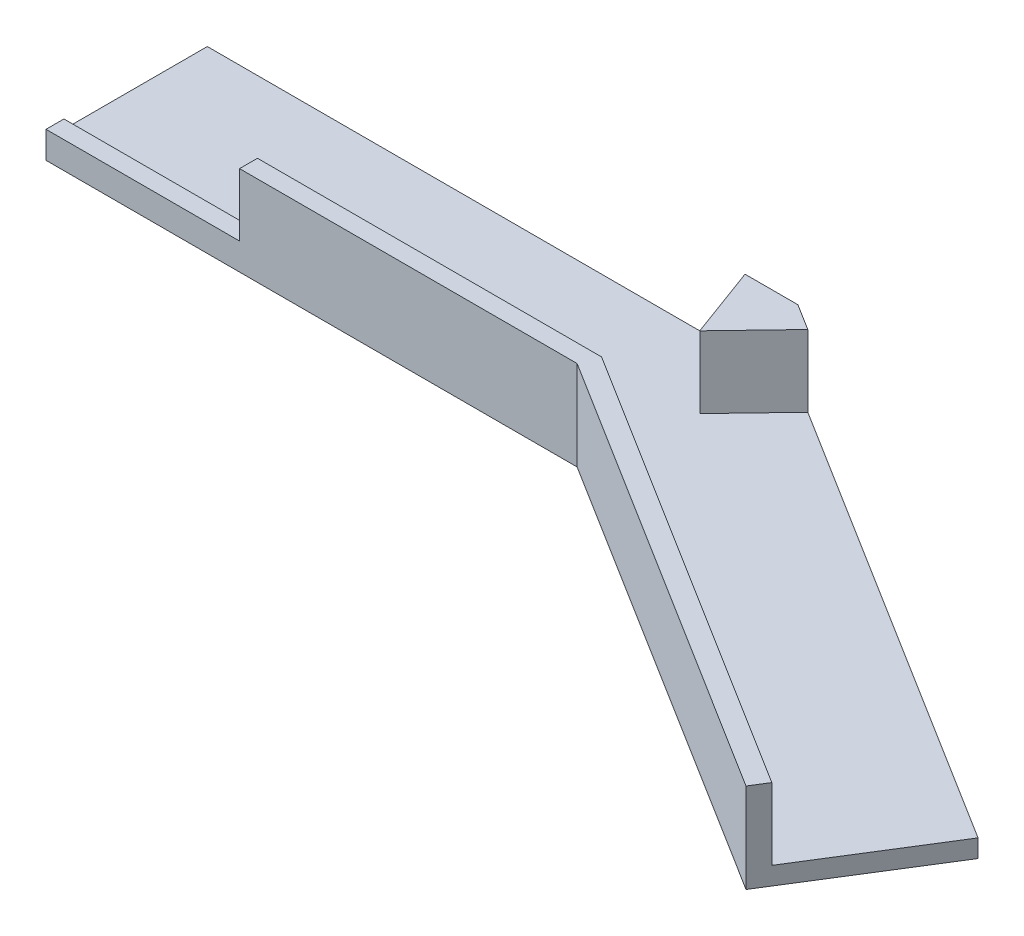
ISO-10303-21;
HEADER;
FILE_DESCRIPTION(('STEP AP214'),'2;1');
FILE_NAME('part.step','',(''),(''),'','','');
FILE_SCHEMA(('AUTOMOTIVE_DESIGN { 1 0 10303 214 1 1 1 1 }'));
ENDSEC;
DATA;
#1=APPLICATION_CONTEXT('core data for automotive mechanical design processes');
#2=APPLICATION_PROTOCOL_DEFINITION('international standard','automotive_design',2000,#1);
#3=PRODUCT_CONTEXT('',#1,'mechanical');
#4=PRODUCT('Part','Part','',(#3));
#5=PRODUCT_RELATED_PRODUCT_CATEGORY('part','',(#4));
#6=PRODUCT_DEFINITION_FORMATION('','',#4);
#7=PRODUCT_DEFINITION_CONTEXT('part definition',#1,'design');
#8=PRODUCT_DEFINITION('design','',#6,#7);
#9=PRODUCT_DEFINITION_SHAPE('','',#8);
#10=(LENGTH_UNIT() NAMED_UNIT(*) SI_UNIT(.MILLI.,.METRE.));
#11=(NAMED_UNIT(*) PLANE_ANGLE_UNIT() SI_UNIT($,.RADIAN.));
#12=(NAMED_UNIT(*) SI_UNIT($,.STERADIAN.) SOLID_ANGLE_UNIT());
#13=UNCERTAINTY_MEASURE_WITH_UNIT(LENGTH_MEASURE(1.E-05),#10,'distance_accuracy_value','');
#14=(GEOMETRIC_REPRESENTATION_CONTEXT(3) GLOBAL_UNCERTAINTY_ASSIGNED_CONTEXT((#13)) GLOBAL_UNIT_ASSIGNED_CONTEXT((#10,
#11,#12)) REPRESENTATION_CONTEXT('',''));
#15=CARTESIAN_POINT('',(0.,0.,0.));
#16=DIRECTION('',(0.,0.,1.));
#17=DIRECTION('',(1.,0.,0.));
#18=AXIS2_PLACEMENT_3D('',#15,#16,#17);
#19=CARTESIAN_POINT('',(0.,2.,0.));
#20=DIRECTION('',(0.,1.,0.));
#21=DIRECTION('',(0.,0.,1.));
#22=AXIS2_PLACEMENT_3D('',#19,#20,#21);
#23=PLANE('',#22);
#24=DIRECTION('',(0.691513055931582,0.,-0.72236396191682));
#25=VECTOR('',#24,1.);
#26=CARTESIAN_POINT('',(62.951355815,2.,-8.));
#27=LINE('',#26,#25);
#28=CARTESIAN_POINT('',(62.951355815,2.,-8.));
#29=VERTEX_POINT('',#28);
#30=CARTESIAN_POINT('',(68.8479189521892,2.,-14.159630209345));
#31=VERTEX_POINT('',#30);
#32=EDGE_CURVE('E176',#29,#31,#27,.T.);
#33=ORIENTED_EDGE('',*,*,#32,.F.);
#34=DIRECTION('',(0.346117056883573,0.,0.938191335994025));
#35=VECTOR('',#34,1.);
#36=CARTESIAN_POINT('',(60.,2.,-16.));
#37=LINE('',#36,#35);
#38=CARTESIAN_POINT('',(60.,2.,-16.));
#39=VERTEX_POINT('',#38);
#40=EDGE_CURVE('E180',#39,#29,#37,.T.);
#41=ORIENTED_EDGE('',*,*,#40,.F.);
#42=DIRECTION('',(1.,0.,0.));
#43=VECTOR('',#42,1.);
#44=CARTESIAN_POINT('',(0.,2.,-16.));
#45=LINE('',#44,#43);
#46=CARTESIAN_POINT('',(0.,2.,-16.));
#47=VERTEX_POINT('',#46);
#48=EDGE_CURVE('E215',#47,#39,#45,.T.);
#49=ORIENTED_EDGE('',*,*,#48,.F.);
#50=DIRECTION('',(0.,0.,-1.));
#51=VECTOR('',#50,1.);
#52=CARTESIAN_POINT('',(0.,2.,0.));
#53=LINE('',#52,#51);
#54=CARTESIAN_POINT('',(0.,2.,0.));
#55=VERTEX_POINT('',#54);
#56=EDGE_CURVE('E220',#55,#47,#53,.T.);
#57=ORIENTED_EDGE('',*,*,#56,.F.);
#58=DIRECTION('',(1.,0.,0.));
#59=VECTOR('',#58,1.);
#60=CARTESIAN_POINT('',(0.,2.,0.));
#61=LINE('',#60,#59);
#62=CARTESIAN_POINT('',(60.,2.,0.));
#63=VERTEX_POINT('',#62);
#64=EDGE_CURVE('E224',#55,#63,#61,.T.);
#65=ORIENTED_EDGE('',*,*,#64,.T.);
#66=DIRECTION('',(0.848048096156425,0.,0.529919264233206));
#67=VECTOR('',#66,1.);
#68=CARTESIAN_POINT('',(16.8488655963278,2.,-26.9638213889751));
#69=LINE('',#68,#67);
#70=CARTESIAN_POINT('',(110.625313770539,2.,31.6342070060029));
#71=VERTEX_POINT('',#70);
#72=EDGE_CURVE('E227',#63,#71,#69,.T.);
#73=ORIENTED_EDGE('',*,*,#72,.T.);
#74=DIRECTION('',(0.529919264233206,0.,-0.848048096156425));
#75=VECTOR('',#74,1.);
#76=CARTESIAN_POINT('',(93.7764481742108,2.,58.5980283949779));
#77=LINE('',#76,#75);
#78=CARTESIAN_POINT('',(119.473232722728,2.,17.4745767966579));
#79=VERTEX_POINT('',#78);
#80=EDGE_CURVE('E230',#71,#79,#77,.T.);
#81=ORIENTED_EDGE('',*,*,#80,.T.);
#82=DIRECTION('',(0.848048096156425,0.,0.529919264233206));
#83=VECTOR('',#82,1.);
#84=CARTESIAN_POINT('',(25.696784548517,2.,-41.1234515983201));
#85=LINE('',#84,#83);
#86=EDGE_CURVE('E212',#31,#79,#85,.T.);
#87=ORIENTED_EDGE('',*,*,#86,.F.);
#88=EDGE_LOOP('',(#33,#41,#49,#57,#65,#73,#81,#87));
#89=FACE_BOUND('',#88,.T.);
#90=ADVANCED_FACE('F41',(#89),#23,.T.);
#91=CARTESIAN_POINT('',(0.,10.,2.));
#92=DIRECTION('',(0.,0.,-1.));
#93=DIRECTION('',(-1.,0.,0.));
#94=AXIS2_PLACEMENT_3D('',#91,#92,#93);
#95=PLANE('',#94);
#96=DIRECTION('',(1.,0.,0.));
#97=VECTOR('',#96,1.);
#98=CARTESIAN_POINT('',(0.,10.,2.));
#99=LINE('',#98,#97);
#100=CARTESIAN_POINT('',(21.5972716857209,10.,2.));
#101=VERTEX_POINT('',#100);
#102=CARTESIAN_POINT('',(59.26216105,10.,2.));
#103=VERTEX_POINT('',#102);
#104=EDGE_CURVE('E93',#101,#103,#99,.T.);
#105=ORIENTED_EDGE('',*,*,#104,.F.);
#106=DIRECTION('',(0.,1.,0.));
#107=VECTOR('',#106,1.);
#108=CARTESIAN_POINT('',(21.5972716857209,3.,2.));
#109=LINE('',#108,#107);
#110=CARTESIAN_POINT('',(21.5972716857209,3.,2.));
#111=VERTEX_POINT('',#110);
#112=EDGE_CURVE('E57',#111,#101,#109,.T.);
#113=ORIENTED_EDGE('',*,*,#112,.F.);
#114=DIRECTION('',(1.,0.,0.));
#115=VECTOR('',#114,1.);
#116=CARTESIAN_POINT('',(0.,3.,2.));
#117=LINE('',#116,#115);
#118=CARTESIAN_POINT('',(0.,3.,2.));
#119=VERTEX_POINT('',#118);
#120=EDGE_CURVE('E195',#119,#111,#117,.T.);
#121=ORIENTED_EDGE('',*,*,#120,.F.);
#122=DIRECTION('',(0.,-1.,0.));
#123=VECTOR('',#122,1.);
#124=CARTESIAN_POINT('',(0.,10.,2.));
#125=LINE('',#124,#123);
#126=CARTESIAN_POINT('',(0.,0.,2.));
#127=VERTEX_POINT('',#126);
#128=EDGE_CURVE('E86',#119,#127,#125,.T.);
#129=ORIENTED_EDGE('',*,*,#128,.T.);
#130=DIRECTION('',(1.,0.,0.));
#131=VECTOR('',#130,1.);
#132=CARTESIAN_POINT('',(0.,0.,2.));
#133=LINE('',#132,#131);
#134=CARTESIAN_POINT('',(59.26216105,0.,2.));
#135=VERTEX_POINT('',#134);
#136=EDGE_CURVE('E251',#127,#135,#133,.T.);
#137=ORIENTED_EDGE('',*,*,#136,.T.);
#138=DIRECTION('',(0.,-1.,0.));
#139=VECTOR('',#138,1.);
#140=CARTESIAN_POINT('',(59.26216105,10.,2.));
#141=LINE('',#140,#139);
#142=EDGE_CURVE('E11',#103,#135,#141,.T.);
#143=ORIENTED_EDGE('',*,*,#142,.F.);
#144=EDGE_LOOP('',(#105,#113,#121,#129,#137,#143));
#145=FACE_BOUND('',#144,.T.);
#146=ADVANCED_FACE('F43',(#145),#95,.F.);
#147=CARTESIAN_POINT('',(15.7428757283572,10.,-25.1938676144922));
#148=DIRECTION('',(0.529919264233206,0.,-0.848048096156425));
#149=DIRECTION('',(-0.848048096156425,0.,-0.529919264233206));
#150=AXIS2_PLACEMENT_3D('',#147,#148,#149);
#151=PLANE('',#150);
#152=DIRECTION('',(0.848048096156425,0.,0.529919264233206));
#153=VECTOR('',#152,1.);
#154=CARTESIAN_POINT('',(15.7428757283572,0.,-25.1938676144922));
#155=LINE('',#154,#153);
#156=CARTESIAN_POINT('',(109.519323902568,0.,33.4041607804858));
#157=VERTEX_POINT('',#156);
#158=EDGE_CURVE('E270',#135,#157,#155,.T.);
#159=ORIENTED_EDGE('',*,*,#158,.T.);
#160=DIRECTION('',(0.,-1.,0.));
#161=VECTOR('',#160,1.);
#162=CARTESIAN_POINT('',(109.519323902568,10.,33.4041607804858));
#163=LINE('',#162,#161);
#164=CARTESIAN_POINT('',(109.519323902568,10.,33.4041607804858));
#165=VERTEX_POINT('',#164);
#166=EDGE_CURVE('E50',#165,#157,#163,.T.);
#167=ORIENTED_EDGE('',*,*,#166,.F.);
#168=DIRECTION('',(0.848048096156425,0.,0.529919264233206));
#169=VECTOR('',#168,1.);
#170=CARTESIAN_POINT('',(15.7428757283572,10.,-25.1938676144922));
#171=LINE('',#170,#169);
#172=EDGE_CURVE('E254',#103,#165,#171,.T.);
#173=ORIENTED_EDGE('',*,*,#172,.F.);
#174=ORIENTED_EDGE('',*,*,#142,.T.);
#175=EDGE_LOOP('',(#159,#167,#173,#174));
#176=FACE_BOUND('',#175,.T.);
#177=ADVANCED_FACE('F298',(#176),#151,.F.);
#178=CARTESIAN_POINT('',(93.7764481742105,10.,58.5980283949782));
#179=DIRECTION('',(0.848048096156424,0.,0.529919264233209));
#180=DIRECTION('',(0.529919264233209,0.,-0.848048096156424));
#181=AXIS2_PLACEMENT_3D('',#178,#179,#180);
#182=PLANE('',#181);
#183=DIRECTION('',(-0.529919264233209,0.,0.848048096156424));
#184=VECTOR('',#183,1.);
#185=CARTESIAN_POINT('',(93.7764481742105,0.,58.5980283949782));
#186=LINE('',#185,#184);
#187=CARTESIAN_POINT('',(119.473232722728,0.,17.4745767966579));
#188=VERTEX_POINT('',#187);
#189=EDGE_CURVE('E274',#188,#157,#186,.T.);
#190=ORIENTED_EDGE('',*,*,#189,.F.);
#191=DIRECTION('',(0.,-1.,0.));
#192=VECTOR('',#191,1.);
#193=CARTESIAN_POINT('',(119.473232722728,2.,17.4745767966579));
#194=LINE('',#193,#192);
#195=EDGE_CURVE('E234',#79,#188,#194,.T.);
#196=ORIENTED_EDGE('',*,*,#195,.F.);
#197=ORIENTED_EDGE('',*,*,#80,.F.);
#198=DIRECTION('',(0.,-1.,0.));
#199=VECTOR('',#198,1.);
#200=CARTESIAN_POINT('',(110.625313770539,10.,31.6342070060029));
#201=LINE('',#200,#199);
#202=CARTESIAN_POINT('',(110.625313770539,10.,31.6342070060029));
#203=VERTEX_POINT('',#202);
#204=EDGE_CURVE('E288',#203,#71,#201,.T.);
#205=ORIENTED_EDGE('',*,*,#204,.F.);
#206=DIRECTION('',(-0.529919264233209,0.,0.848048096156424));
#207=VECTOR('',#206,1.);
#208=CARTESIAN_POINT('',(93.7764481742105,10.,58.5980283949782));
#209=LINE('',#208,#207);
#210=EDGE_CURVE('E258',#203,#165,#209,.T.);
#211=ORIENTED_EDGE('',*,*,#210,.T.);
#212=ORIENTED_EDGE('',*,*,#166,.T.);
#213=EDGE_LOOP('',(#190,#196,#197,#205,#211,#212));
#214=FACE_BOUND('',#213,.T.);
#215=ADVANCED_FACE('F294',(#214),#182,.T.);
#216=CARTESIAN_POINT('',(16.8488655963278,10.,-26.9638213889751));
#217=DIRECTION('',(0.529919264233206,0.,-0.848048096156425));
#218=DIRECTION('',(-0.848048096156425,0.,-0.529919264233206));
#219=AXIS2_PLACEMENT_3D('',#216,#217,#218);
#220=PLANE('',#219);
#221=ORIENTED_EDGE('',*,*,#72,.F.);
#222=DIRECTION('',(0.,-1.,0.));
#223=VECTOR('',#222,1.);
#224=CARTESIAN_POINT('',(60.,10.,0.));
#225=LINE('',#224,#223);
#226=CARTESIAN_POINT('',(60.,10.,0.));
#227=VERTEX_POINT('',#226);
#228=EDGE_CURVE('E285',#227,#63,#225,.T.);
#229=ORIENTED_EDGE('',*,*,#228,.F.);
#230=DIRECTION('',(0.848048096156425,0.,0.529919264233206));
#231=VECTOR('',#230,1.);
#232=CARTESIAN_POINT('',(16.8488655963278,10.,-26.9638213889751));
#233=LINE('',#232,#231);
#234=EDGE_CURVE('E262',#227,#203,#233,.T.);
#235=ORIENTED_EDGE('',*,*,#234,.T.);
#236=ORIENTED_EDGE('',*,*,#204,.T.);
#237=EDGE_LOOP('',(#221,#229,#235,#236));
#238=FACE_BOUND('',#237,.T.);
#239=ADVANCED_FACE('F312',(#238),#220,.T.);
#240=CARTESIAN_POINT('',(0.,10.,0.));
#241=DIRECTION('',(0.,0.,-1.));
#242=DIRECTION('',(-1.,0.,0.));
#243=AXIS2_PLACEMENT_3D('',#240,#241,#242);
#244=PLANE('',#243);
#245=DIRECTION('',(0.,1.,0.));
#246=VECTOR('',#245,1.);
#247=CARTESIAN_POINT('',(21.5972716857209,3.,0.));
#248=LINE('',#247,#246);
#249=CARTESIAN_POINT('',(21.5972716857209,3.,0.));
#250=VERTEX_POINT('',#249);
#251=CARTESIAN_POINT('',(21.5972716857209,10.,0.));
#252=VERTEX_POINT('',#251);
#253=EDGE_CURVE('E206',#250,#252,#248,.T.);
#254=ORIENTED_EDGE('',*,*,#253,.T.);
#255=DIRECTION('',(1.,0.,0.));
#256=VECTOR('',#255,1.);
#257=CARTESIAN_POINT('',(0.,10.,0.));
#258=LINE('',#257,#256);
#259=EDGE_CURVE('E66',#252,#227,#258,.T.);
#260=ORIENTED_EDGE('',*,*,#259,.T.);
#261=ORIENTED_EDGE('',*,*,#228,.T.);
#262=ORIENTED_EDGE('',*,*,#64,.F.);
#263=DIRECTION('',(0.,-1.,0.));
#264=VECTOR('',#263,1.);
#265=CARTESIAN_POINT('',(0.,10.,0.));
#266=LINE('',#265,#264);
#267=CARTESIAN_POINT('',(0.,3.,0.));
#268=VERTEX_POINT('',#267);
#269=EDGE_CURVE('E282',#268,#55,#266,.T.);
#270=ORIENTED_EDGE('',*,*,#269,.F.);
#271=DIRECTION('',(-1.,0.,0.));
#272=VECTOR('',#271,1.);
#273=CARTESIAN_POINT('',(0.,3.,0.));
#274=LINE('',#273,#272);
#275=EDGE_CURVE('E203',#250,#268,#274,.T.);
#276=ORIENTED_EDGE('',*,*,#275,.F.);
#277=EDGE_LOOP('',(#254,#260,#261,#262,#270,#276));
#278=FACE_BOUND('',#277,.T.);
#279=ADVANCED_FACE('F349',(#278),#244,.T.);
#280=CARTESIAN_POINT('',(0.,10.,0.));
#281=DIRECTION('',(1.,0.,0.));
#282=DIRECTION('',(0.,0.,-1.));
#283=AXIS2_PLACEMENT_3D('',#280,#281,#282);
#284=PLANE('',#283);
#285=ORIENTED_EDGE('',*,*,#128,.F.);
#286=DIRECTION('',(0.,0.,1.));
#287=VECTOR('',#286,1.);
#288=CARTESIAN_POINT('',(0.,3.,2.));
#289=LINE('',#288,#287);
#290=EDGE_CURVE('E187',#268,#119,#289,.T.);
#291=ORIENTED_EDGE('',*,*,#290,.F.);
#292=ORIENTED_EDGE('',*,*,#269,.T.);
#293=ORIENTED_EDGE('',*,*,#56,.T.);
#294=DIRECTION('',(0.,-1.,0.));
#295=VECTOR('',#294,1.);
#296=CARTESIAN_POINT('',(0.,2.,-16.));
#297=LINE('',#296,#295);
#298=CARTESIAN_POINT('',(0.,0.,-16.));
#299=VERTEX_POINT('',#298);
#300=EDGE_CURVE('E244',#47,#299,#297,.T.);
#301=ORIENTED_EDGE('',*,*,#300,.T.);
#302=DIRECTION('',(0.,0.,1.));
#303=VECTOR('',#302,1.);
#304=CARTESIAN_POINT('',(0.,0.,0.));
#305=LINE('',#304,#303);
#306=EDGE_CURVE('E255',#299,#127,#305,.T.);
#307=ORIENTED_EDGE('',*,*,#306,.T.);
#308=EDGE_LOOP('',(#285,#291,#292,#293,#301,#307));
#309=FACE_BOUND('',#308,.T.);
#310=ADVANCED_FACE('F316',(#309),#284,.F.);
#311=CARTESIAN_POINT('',(0.,10.,0.));
#312=DIRECTION('',(0.,1.,0.));
#313=DIRECTION('',(0.,0.,1.));
#314=AXIS2_PLACEMENT_3D('',#311,#312,#313);
#315=PLANE('',#314);
#316=DIRECTION('',(0.,0.,-1.));
#317=VECTOR('',#316,1.);
#318=CARTESIAN_POINT('',(21.5972716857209,10.,2.));
#319=LINE('',#318,#317);
#320=EDGE_CURVE('E183',#101,#252,#319,.T.);
#321=ORIENTED_EDGE('',*,*,#320,.F.);
#322=ORIENTED_EDGE('',*,*,#104,.T.);
#323=ORIENTED_EDGE('',*,*,#172,.T.);
#324=ORIENTED_EDGE('',*,*,#210,.F.);
#325=ORIENTED_EDGE('',*,*,#234,.F.);
#326=ORIENTED_EDGE('',*,*,#259,.F.);
#327=EDGE_LOOP('',(#321,#322,#323,#324,#325,#326));
#328=FACE_BOUND('',#327,.T.);
#329=ADVANCED_FACE('F314',(#328),#315,.T.);
#330=CARTESIAN_POINT('',(0.,0.,0.));
#331=DIRECTION('',(0.,1.,0.));
#332=DIRECTION('',(0.,0.,1.));
#333=AXIS2_PLACEMENT_3D('',#330,#331,#332);
#334=PLANE('',#333);
#335=ORIENTED_EDGE('',*,*,#136,.F.);
#336=ORIENTED_EDGE('',*,*,#306,.F.);
#337=DIRECTION('',(1.,0.,0.));
#338=VECTOR('',#337,1.);
#339=CARTESIAN_POINT('',(0.,0.,-16.));
#340=LINE('',#339,#338);
#341=CARTESIAN_POINT('',(65.90271163,0.,-16.));
#342=VERTEX_POINT('',#341);
#343=EDGE_CURVE('E216',#299,#342,#340,.T.);
#344=ORIENTED_EDGE('',*,*,#343,.T.);
#345=DIRECTION('',(0.848048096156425,0.,0.529919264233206));
#346=VECTOR('',#345,1.);
#347=CARTESIAN_POINT('',(25.696784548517,0.,-41.1234515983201));
#348=LINE('',#347,#346);
#349=EDGE_CURVE('E209',#342,#188,#348,.T.);
#350=ORIENTED_EDGE('',*,*,#349,.T.);
#351=ORIENTED_EDGE('',*,*,#189,.T.);
#352=ORIENTED_EDGE('',*,*,#158,.F.);
#353=EDGE_LOOP('',(#335,#336,#344,#350,#351,#352));
#354=FACE_BOUND('',#353,.T.);
#355=ADVANCED_FACE('F302',(#354),#334,.F.);
#356=CARTESIAN_POINT('',(25.696784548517,2.,-41.1234515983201));
#357=DIRECTION('',(0.529919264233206,0.,-0.848048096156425));
#358=DIRECTION('',(-0.848048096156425,0.,-0.529919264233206));
#359=AXIS2_PLACEMENT_3D('',#356,#357,#358);
#360=PLANE('',#359);
#361=ORIENTED_EDGE('',*,*,#349,.F.);
#362=DIRECTION('',(0.,-1.,0.));
#363=VECTOR('',#362,1.);
#364=CARTESIAN_POINT('',(65.90271163,2.,-16.));
#365=LINE('',#364,#363);
#366=CARTESIAN_POINT('',(65.90271163,10.,-16.));
#367=VERTEX_POINT('',#366);
#368=EDGE_CURVE('E248',#367,#342,#365,.T.);
#369=ORIENTED_EDGE('',*,*,#368,.F.);
#370=DIRECTION('',(-0.848048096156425,0.,-0.529919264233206));
#371=VECTOR('',#370,1.);
#372=CARTESIAN_POINT('',(68.8479189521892,10.,-14.159630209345));
#373=LINE('',#372,#371);
#374=CARTESIAN_POINT('',(68.8479189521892,10.,-14.159630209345));
#375=VERTEX_POINT('',#374);
#376=EDGE_CURVE('E166',#375,#367,#373,.T.);
#377=ORIENTED_EDGE('',*,*,#376,.F.);
#378=DIRECTION('',(0.,-1.,0.));
#379=VECTOR('',#378,1.);
#380=CARTESIAN_POINT('',(68.8479189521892,10.,-14.159630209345));
#381=LINE('',#380,#379);
#382=EDGE_CURVE('E161',#375,#31,#381,.T.);
#383=ORIENTED_EDGE('',*,*,#382,.T.);
#384=ORIENTED_EDGE('',*,*,#86,.T.);
#385=ORIENTED_EDGE('',*,*,#195,.T.);
#386=EDGE_LOOP('',(#361,#369,#377,#383,#384,#385));
#387=FACE_BOUND('',#386,.T.);
#388=ADVANCED_FACE('F306',(#387),#360,.T.);
#389=CARTESIAN_POINT('',(0.,2.,-16.));
#390=DIRECTION('',(0.,0.,-1.));
#391=DIRECTION('',(-1.,0.,0.));
#392=AXIS2_PLACEMENT_3D('',#389,#390,#391);
#393=PLANE('',#392);
#394=ORIENTED_EDGE('',*,*,#343,.F.);
#395=ORIENTED_EDGE('',*,*,#300,.F.);
#396=ORIENTED_EDGE('',*,*,#48,.T.);
#397=DIRECTION('',(0.,-1.,0.));
#398=VECTOR('',#397,1.);
#399=CARTESIAN_POINT('',(60.,10.,-16.));
#400=LINE('',#399,#398);
#401=CARTESIAN_POINT('',(60.,10.,-16.));
#402=VERTEX_POINT('',#401);
#403=EDGE_CURVE('E189',#402,#39,#400,.T.);
#404=ORIENTED_EDGE('',*,*,#403,.F.);
#405=DIRECTION('',(-1.,0.,0.));
#406=VECTOR('',#405,1.);
#407=CARTESIAN_POINT('',(65.90271163,10.,-16.));
#408=LINE('',#407,#406);
#409=EDGE_CURVE('E172',#367,#402,#408,.T.);
#410=ORIENTED_EDGE('',*,*,#409,.F.);
#411=ORIENTED_EDGE('',*,*,#368,.T.);
#412=EDGE_LOOP('',(#394,#395,#396,#404,#410,#411));
#413=FACE_BOUND('',#412,.T.);
#414=ADVANCED_FACE('F320',(#413),#393,.T.);
#415=CARTESIAN_POINT('',(21.5972716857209,3.,2.));
#416=DIRECTION('',(1.,0.,0.));
#417=DIRECTION('',(0.,0.,-1.));
#418=AXIS2_PLACEMENT_3D('',#415,#416,#417);
#419=PLANE('',#418);
#420=ORIENTED_EDGE('',*,*,#320,.T.);
#421=ORIENTED_EDGE('',*,*,#253,.F.);
#422=DIRECTION('',(0.,0.,-1.));
#423=VECTOR('',#422,1.);
#424=CARTESIAN_POINT('',(21.5972716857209,3.,2.));
#425=LINE('',#424,#423);
#426=EDGE_CURVE('E199',#111,#250,#425,.T.);
#427=ORIENTED_EDGE('',*,*,#426,.F.);
#428=ORIENTED_EDGE('',*,*,#112,.T.);
#429=EDGE_LOOP('',(#420,#421,#427,#428));
#430=FACE_BOUND('',#429,.T.);
#431=ADVANCED_FACE('F337',(#430),#419,.F.);
#432=CARTESIAN_POINT('',(0.,3.,0.));
#433=DIRECTION('',(0.,-1.,0.));
#434=DIRECTION('',(0.,0.,-1.));
#435=AXIS2_PLACEMENT_3D('',#432,#433,#434);
#436=PLANE('',#435);
#437=ORIENTED_EDGE('',*,*,#290,.T.);
#438=ORIENTED_EDGE('',*,*,#120,.T.);
#439=ORIENTED_EDGE('',*,*,#426,.T.);
#440=ORIENTED_EDGE('',*,*,#275,.T.);
#441=EDGE_LOOP('',(#437,#438,#439,#440));
#442=FACE_BOUND('',#441,.T.);
#443=ADVANCED_FACE('F399',(#442),#436,.F.);
#444=CARTESIAN_POINT('',(60.,10.,-16.));
#445=DIRECTION('',(0.938191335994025,0.,-0.346117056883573));
#446=DIRECTION('',(-0.346117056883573,0.,-0.938191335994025));
#447=AXIS2_PLACEMENT_3D('',#444,#445,#446);
#448=PLANE('',#447);
#449=ORIENTED_EDGE('',*,*,#40,.T.);
#450=DIRECTION('',(0.,-1.,0.));
#451=VECTOR('',#450,1.);
#452=CARTESIAN_POINT('',(62.951355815,10.,-8.));
#453=LINE('',#452,#451);
#454=CARTESIAN_POINT('',(62.951355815,10.,-8.));
#455=VERTEX_POINT('',#454);
#456=EDGE_CURVE('E158',#455,#29,#453,.T.);
#457=ORIENTED_EDGE('',*,*,#456,.F.);
#458=DIRECTION('',(0.346117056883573,0.,0.938191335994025));
#459=VECTOR('',#458,1.);
#460=CARTESIAN_POINT('',(60.,10.,-16.));
#461=LINE('',#460,#459);
#462=EDGE_CURVE('E167',#402,#455,#461,.T.);
#463=ORIENTED_EDGE('',*,*,#462,.F.);
#464=ORIENTED_EDGE('',*,*,#403,.T.);
#465=EDGE_LOOP('',(#449,#457,#463,#464));
#466=FACE_BOUND('',#465,.T.);
#467=ADVANCED_FACE('F178',(#466),#448,.F.);
#468=CARTESIAN_POINT('',(62.951355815,10.,-8.));
#469=DIRECTION('',(-0.72236396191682,0.,-0.691513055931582));
#470=DIRECTION('',(-0.691513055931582,0.,0.72236396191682));
#471=AXIS2_PLACEMENT_3D('',#468,#469,#470);
#472=PLANE('',#471);
#473=ORIENTED_EDGE('',*,*,#32,.T.);
#474=ORIENTED_EDGE('',*,*,#382,.F.);
#475=DIRECTION('',(0.691513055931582,0.,-0.72236396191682));
#476=VECTOR('',#475,1.);
#477=CARTESIAN_POINT('',(62.951355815,10.,-8.));
#478=LINE('',#477,#476);
#479=EDGE_CURVE('E154',#455,#375,#478,.T.);
#480=ORIENTED_EDGE('',*,*,#479,.F.);
#481=ORIENTED_EDGE('',*,*,#456,.T.);
#482=EDGE_LOOP('',(#473,#474,#480,#481));
#483=FACE_BOUND('',#482,.T.);
#484=ADVANCED_FACE('F156',(#483),#472,.F.);
#485=CARTESIAN_POINT('',(0.,10.,0.));
#486=DIRECTION('',(0.,-1.,0.));
#487=DIRECTION('',(0.,0.,-1.));
#488=AXIS2_PLACEMENT_3D('',#485,#486,#487);
#489=PLANE('',#488);
#490=ORIENTED_EDGE('',*,*,#462,.T.);
#491=ORIENTED_EDGE('',*,*,#479,.T.);
#492=ORIENTED_EDGE('',*,*,#376,.T.);
#493=ORIENTED_EDGE('',*,*,#409,.T.);
#494=EDGE_LOOP('',(#490,#491,#492,#493));
#495=FACE_BOUND('',#494,.T.);
#496=ADVANCED_FACE('F170',(#495),#489,.F.);
#497=CLOSED_SHELL('',(#90,#146,#177,#215,#239,#279,#310,#329,#355,#388,#414,#431,#443,#467,#484,#496));
#498=MANIFOLD_SOLID_BREP('B2',#497);
#499=ADVANCED_BREP_SHAPE_REPRESENTATION('',(#18,#498),#14);
#500=SHAPE_DEFINITION_REPRESENTATION(#9,#499);
ENDSEC;
END-ISO-10303-21;
